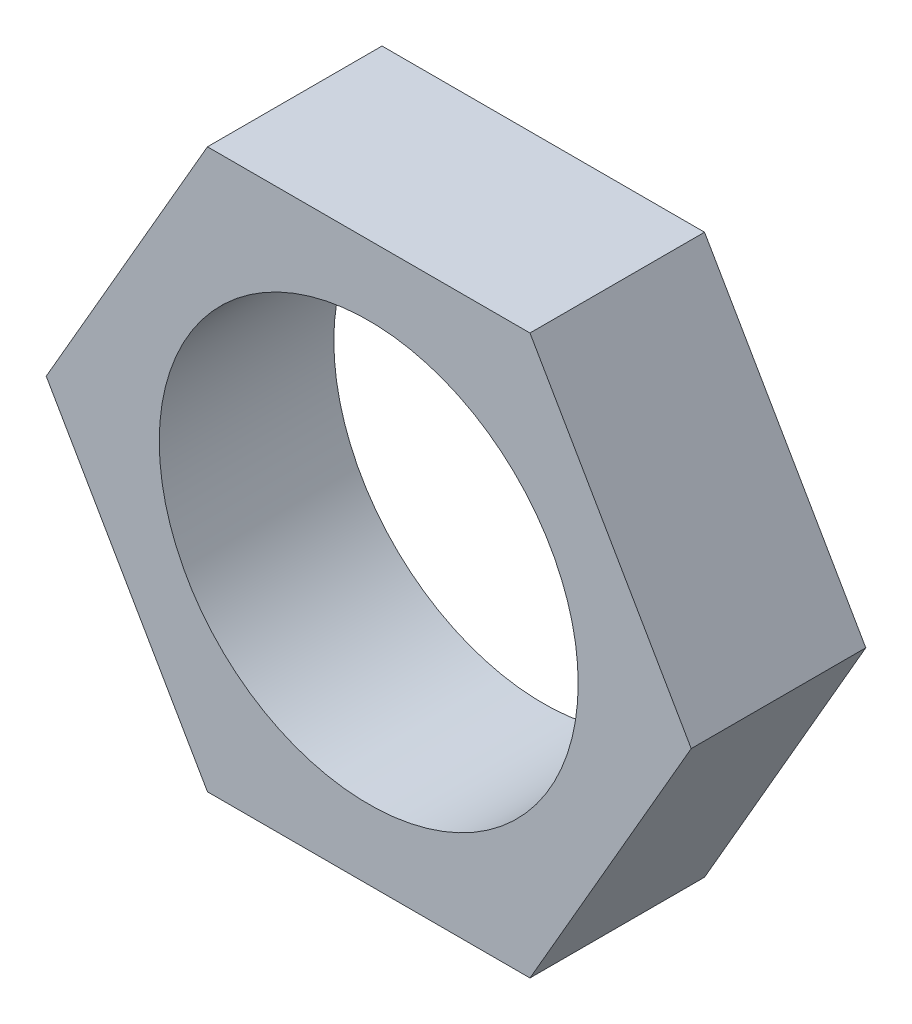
ISO-10303-21;
HEADER;
FILE_DESCRIPTION(('STEP AP214'),'2;1');
FILE_NAME('part.step','',(''),(''),'','','');
FILE_SCHEMA(('AUTOMOTIVE_DESIGN { 1 0 10303 214 1 1 1 1 }'));
ENDSEC;
DATA;
#1=APPLICATION_CONTEXT('core data for automotive mechanical design processes');
#2=APPLICATION_PROTOCOL_DEFINITION('international standard','automotive_design',2000,#1);
#3=PRODUCT_CONTEXT('',#1,'mechanical');
#4=PRODUCT('Part','Part','',(#3));
#5=PRODUCT_RELATED_PRODUCT_CATEGORY('part','',(#4));
#6=PRODUCT_DEFINITION_FORMATION('','',#4);
#7=PRODUCT_DEFINITION_CONTEXT('part definition',#1,'design');
#8=PRODUCT_DEFINITION('design','',#6,#7);
#9=PRODUCT_DEFINITION_SHAPE('','',#8);
#10=(LENGTH_UNIT() NAMED_UNIT(*) SI_UNIT(.MILLI.,.METRE.));
#11=(NAMED_UNIT(*) PLANE_ANGLE_UNIT() SI_UNIT($,.RADIAN.));
#12=(NAMED_UNIT(*) SI_UNIT($,.STERADIAN.) SOLID_ANGLE_UNIT());
#13=UNCERTAINTY_MEASURE_WITH_UNIT(LENGTH_MEASURE(1.E-05),#10,'distance_accuracy_value','');
#14=(GEOMETRIC_REPRESENTATION_CONTEXT(3) GLOBAL_UNCERTAINTY_ASSIGNED_CONTEXT((#13)) GLOBAL_UNIT_ASSIGNED_CONTEXT((#10,
#11,#12)) REPRESENTATION_CONTEXT('',''));
#15=CARTESIAN_POINT('',(0.,0.,0.));
#16=DIRECTION('',(0.,0.,1.));
#17=DIRECTION('',(1.,0.,0.));
#18=AXIS2_PLACEMENT_3D('',#15,#16,#17);
#19=CARTESIAN_POINT('',(0.,0.,5.));
#20=DIRECTION('',(0.,0.,1.));
#21=DIRECTION('',(1.,0.,0.));
#22=AXIS2_PLACEMENT_3D('',#19,#20,#21);
#23=PLANE('',#22);
#24=DIRECTION('',(0.5,0.866025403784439,0.));
#25=VECTOR('',#24,1.);
#26=CARTESIAN_POINT('',(4.618802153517,-8.00000000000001,5.));
#27=LINE('',#26,#25);
#28=CARTESIAN_POINT('',(4.618802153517,-8.00000000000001,5.));
#29=VERTEX_POINT('',#28);
#30=CARTESIAN_POINT('',(9.23760430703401,0.,5.));
#31=VERTEX_POINT('',#30);
#32=EDGE_CURVE('E132',#29,#31,#27,.T.);
#33=ORIENTED_EDGE('',*,*,#32,.T.);
#34=DIRECTION('',(-0.5,0.866025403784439,0.));
#35=VECTOR('',#34,1.);
#36=CARTESIAN_POINT('',(9.23760430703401,0.,5.));
#37=LINE('',#36,#35);
#38=CARTESIAN_POINT('',(4.61880215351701,8.,5.));
#39=VERTEX_POINT('',#38);
#40=EDGE_CURVE('E90',#31,#39,#37,.T.);
#41=ORIENTED_EDGE('',*,*,#40,.T.);
#42=DIRECTION('',(-1.,0.,0.));
#43=VECTOR('',#42,1.);
#44=CARTESIAN_POINT('',(4.61880215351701,8.,5.));
#45=LINE('',#44,#43);
#46=CARTESIAN_POINT('',(-4.61880215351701,8.,5.));
#47=VERTEX_POINT('',#46);
#48=EDGE_CURVE('E103',#39,#47,#45,.T.);
#49=ORIENTED_EDGE('',*,*,#48,.T.);
#50=DIRECTION('',(-0.5,-0.866025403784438,0.));
#51=VECTOR('',#50,1.);
#52=CARTESIAN_POINT('',(-4.61880215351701,8.,5.));
#53=LINE('',#52,#51);
#54=CARTESIAN_POINT('',(-9.23760430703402,0.,5.));
#55=VERTEX_POINT('',#54);
#56=EDGE_CURVE('E97',#47,#55,#53,.T.);
#57=ORIENTED_EDGE('',*,*,#56,.T.);
#58=DIRECTION('',(0.5,-0.866025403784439,0.));
#59=VECTOR('',#58,1.);
#60=CARTESIAN_POINT('',(-9.23760430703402,0.,5.));
#61=LINE('',#60,#59);
#62=CARTESIAN_POINT('',(-4.61880215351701,-8.,5.));
#63=VERTEX_POINT('',#62);
#64=EDGE_CURVE('E101',#55,#63,#61,.T.);
#65=ORIENTED_EDGE('',*,*,#64,.T.);
#66=DIRECTION('',(1.,0.,0.));
#67=VECTOR('',#66,1.);
#68=CARTESIAN_POINT('',(-4.61880215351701,-8.,5.));
#69=LINE('',#68,#67);
#70=EDGE_CURVE('E53',#63,#29,#69,.T.);
#71=ORIENTED_EDGE('',*,*,#70,.T.);
#72=EDGE_LOOP('',(#33,#41,#49,#57,#65,#71));
#73=FACE_BOUND('',#72,.T.);
#74=CARTESIAN_POINT('',(0.,0.,5.));
#75=DIRECTION('',(0.,0.,1.));
#76=DIRECTION('',(1.,0.,0.));
#77=AXIS2_PLACEMENT_3D('',#74,#75,#76);
#78=CIRCLE('',#77,6.);
#79=CARTESIAN_POINT('',(6.,0.,5.));
#80=VERTEX_POINT('',#79);
#81=EDGE_CURVE('E125',#80,#80,#78,.T.);
#82=ORIENTED_EDGE('',*,*,#81,.F.);
#83=EDGE_LOOP('',(#82));
#84=FACE_BOUND('',#83,.T.);
#85=ADVANCED_FACE('F36',(#73,#84),#23,.T.);
#86=CARTESIAN_POINT('',(0.,0.,0.));
#87=DIRECTION('',(0.,0.,1.));
#88=DIRECTION('',(1.,0.,0.));
#89=AXIS2_PLACEMENT_3D('',#86,#87,#88);
#90=PLANE('',#89);
#91=DIRECTION('',(0.5,0.866025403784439,0.));
#92=VECTOR('',#91,1.);
#93=CARTESIAN_POINT('',(4.618802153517,-8.00000000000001,0.));
#94=LINE('',#93,#92);
#95=CARTESIAN_POINT('',(4.618802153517,-8.00000000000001,0.));
#96=VERTEX_POINT('',#95);
#97=CARTESIAN_POINT('',(9.23760430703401,0.,0.));
#98=VERTEX_POINT('',#97);
#99=EDGE_CURVE('E121',#96,#98,#94,.T.);
#100=ORIENTED_EDGE('',*,*,#99,.F.);
#101=DIRECTION('',(1.,0.,0.));
#102=VECTOR('',#101,1.);
#103=CARTESIAN_POINT('',(-4.61880215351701,-8.,0.));
#104=LINE('',#103,#102);
#105=CARTESIAN_POINT('',(-4.61880215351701,-8.,0.));
#106=VERTEX_POINT('',#105);
#107=EDGE_CURVE('E82',#106,#96,#104,.T.);
#108=ORIENTED_EDGE('',*,*,#107,.F.);
#109=DIRECTION('',(0.5,-0.866025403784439,0.));
#110=VECTOR('',#109,1.);
#111=CARTESIAN_POINT('',(-9.23760430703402,0.,0.));
#112=LINE('',#111,#110);
#113=CARTESIAN_POINT('',(-9.23760430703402,0.,0.));
#114=VERTEX_POINT('',#113);
#115=EDGE_CURVE('E76',#114,#106,#112,.T.);
#116=ORIENTED_EDGE('',*,*,#115,.F.);
#117=DIRECTION('',(-0.5,-0.866025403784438,0.));
#118=VECTOR('',#117,1.);
#119=CARTESIAN_POINT('',(-4.61880215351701,8.,0.));
#120=LINE('',#119,#118);
#121=CARTESIAN_POINT('',(-4.61880215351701,8.,0.));
#122=VERTEX_POINT('',#121);
#123=EDGE_CURVE('E111',#122,#114,#120,.T.);
#124=ORIENTED_EDGE('',*,*,#123,.F.);
#125=DIRECTION('',(-1.,0.,0.));
#126=VECTOR('',#125,1.);
#127=CARTESIAN_POINT('',(4.61880215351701,8.,0.));
#128=LINE('',#127,#126);
#129=CARTESIAN_POINT('',(4.61880215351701,8.,0.));
#130=VERTEX_POINT('',#129);
#131=EDGE_CURVE('E127',#130,#122,#128,.T.);
#132=ORIENTED_EDGE('',*,*,#131,.F.);
#133=DIRECTION('',(-0.5,0.866025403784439,0.));
#134=VECTOR('',#133,1.);
#135=CARTESIAN_POINT('',(9.23760430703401,0.,0.));
#136=LINE('',#135,#134);
#137=EDGE_CURVE('E124',#98,#130,#136,.T.);
#138=ORIENTED_EDGE('',*,*,#137,.F.);
#139=EDGE_LOOP('',(#100,#108,#116,#124,#132,#138));
#140=FACE_BOUND('',#139,.T.);
#141=CARTESIAN_POINT('',(0.,0.,0.));
#142=DIRECTION('',(0.,0.,1.));
#143=DIRECTION('',(1.,0.,0.));
#144=AXIS2_PLACEMENT_3D('',#141,#142,#143);
#145=CIRCLE('',#144,6.);
#146=CARTESIAN_POINT('',(6.,0.,0.));
#147=VERTEX_POINT('',#146);
#148=EDGE_CURVE('E243',#147,#147,#145,.T.);
#149=ORIENTED_EDGE('',*,*,#148,.T.);
#150=EDGE_LOOP('',(#149));
#151=FACE_BOUND('',#150,.T.);
#152=ADVANCED_FACE('F141',(#140,#151),#90,.F.);
#153=CARTESIAN_POINT('',(4.618802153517,-8.00000000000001,5.));
#154=DIRECTION('',(-0.866025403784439,0.5,0.));
#155=DIRECTION('',(-0.5,-0.866025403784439,0.));
#156=AXIS2_PLACEMENT_3D('',#153,#154,#155);
#157=PLANE('',#156);
#158=ORIENTED_EDGE('',*,*,#99,.T.);
#159=DIRECTION('',(0.,0.,-1.));
#160=VECTOR('',#159,1.);
#161=CARTESIAN_POINT('',(9.23760430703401,0.,5.));
#162=LINE('',#161,#160);
#163=EDGE_CURVE('E11',#31,#98,#162,.T.);
#164=ORIENTED_EDGE('',*,*,#163,.F.);
#165=ORIENTED_EDGE('',*,*,#32,.F.);
#166=DIRECTION('',(0.,0.,-1.));
#167=VECTOR('',#166,1.);
#168=CARTESIAN_POINT('',(4.618802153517,-8.00000000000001,5.));
#169=LINE('',#168,#167);
#170=EDGE_CURVE('E117',#29,#96,#169,.T.);
#171=ORIENTED_EDGE('',*,*,#170,.T.);
#172=EDGE_LOOP('',(#158,#164,#165,#171));
#173=FACE_BOUND('',#172,.T.);
#174=ADVANCED_FACE('F38',(#173),#157,.F.);
#175=CARTESIAN_POINT('',(9.23760430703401,0.,5.));
#176=DIRECTION('',(-0.866025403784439,-0.5,0.));
#177=DIRECTION('',(0.5,-0.866025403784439,0.));
#178=AXIS2_PLACEMENT_3D('',#175,#176,#177);
#179=PLANE('',#178);
#180=ORIENTED_EDGE('',*,*,#137,.T.);
#181=DIRECTION('',(0.,0.,-1.));
#182=VECTOR('',#181,1.);
#183=CARTESIAN_POINT('',(4.61880215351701,8.,5.));
#184=LINE('',#183,#182);
#185=EDGE_CURVE('E45',#39,#130,#184,.T.);
#186=ORIENTED_EDGE('',*,*,#185,.F.);
#187=ORIENTED_EDGE('',*,*,#40,.F.);
#188=ORIENTED_EDGE('',*,*,#163,.T.);
#189=EDGE_LOOP('',(#180,#186,#187,#188));
#190=FACE_BOUND('',#189,.T.);
#191=ADVANCED_FACE('F166',(#190),#179,.F.);
#192=CARTESIAN_POINT('',(4.61880215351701,8.,5.));
#193=DIRECTION('',(0.,-1.,0.));
#194=DIRECTION('',(1.,0.,0.));
#195=AXIS2_PLACEMENT_3D('',#192,#193,#194);
#196=PLANE('',#195);
#197=ORIENTED_EDGE('',*,*,#131,.T.);
#198=DIRECTION('',(0.,0.,-1.));
#199=VECTOR('',#198,1.);
#200=CARTESIAN_POINT('',(-4.61880215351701,8.,5.));
#201=LINE('',#200,#199);
#202=EDGE_CURVE('E112',#47,#122,#201,.T.);
#203=ORIENTED_EDGE('',*,*,#202,.F.);
#204=ORIENTED_EDGE('',*,*,#48,.F.);
#205=ORIENTED_EDGE('',*,*,#185,.T.);
#206=EDGE_LOOP('',(#197,#203,#204,#205));
#207=FACE_BOUND('',#206,.T.);
#208=ADVANCED_FACE('F138',(#207),#196,.F.);
#209=CARTESIAN_POINT('',(-4.61880215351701,8.,5.));
#210=DIRECTION('',(0.866025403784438,-0.5,0.));
#211=DIRECTION('',(0.5,0.866025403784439,0.));
#212=AXIS2_PLACEMENT_3D('',#209,#210,#211);
#213=PLANE('',#212);
#214=ORIENTED_EDGE('',*,*,#123,.T.);
#215=DIRECTION('',(0.,0.,-1.));
#216=VECTOR('',#215,1.);
#217=CARTESIAN_POINT('',(-9.23760430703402,0.,5.));
#218=LINE('',#217,#216);
#219=EDGE_CURVE('E108',#55,#114,#218,.T.);
#220=ORIENTED_EDGE('',*,*,#219,.F.);
#221=ORIENTED_EDGE('',*,*,#56,.F.);
#222=ORIENTED_EDGE('',*,*,#202,.T.);
#223=EDGE_LOOP('',(#214,#220,#221,#222));
#224=FACE_BOUND('',#223,.T.);
#225=ADVANCED_FACE('F109',(#224),#213,.F.);
#226=CARTESIAN_POINT('',(-9.23760430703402,0.,5.));
#227=DIRECTION('',(0.866025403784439,0.5,0.));
#228=DIRECTION('',(-0.5,0.866025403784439,0.));
#229=AXIS2_PLACEMENT_3D('',#226,#227,#228);
#230=PLANE('',#229);
#231=ORIENTED_EDGE('',*,*,#115,.T.);
#232=DIRECTION('',(0.,0.,-1.));
#233=VECTOR('',#232,1.);
#234=CARTESIAN_POINT('',(-4.61880215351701,-8.,5.));
#235=LINE('',#234,#233);
#236=EDGE_CURVE('E113',#63,#106,#235,.T.);
#237=ORIENTED_EDGE('',*,*,#236,.F.);
#238=ORIENTED_EDGE('',*,*,#64,.F.);
#239=ORIENTED_EDGE('',*,*,#219,.T.);
#240=EDGE_LOOP('',(#231,#237,#238,#239));
#241=FACE_BOUND('',#240,.T.);
#242=ADVANCED_FACE('F115',(#241),#230,.F.);
#243=CARTESIAN_POINT('',(-4.61880215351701,-8.,5.));
#244=DIRECTION('',(0.,1.,0.));
#245=DIRECTION('',(-1.,0.,0.));
#246=AXIS2_PLACEMENT_3D('',#243,#244,#245);
#247=PLANE('',#246);
#248=ORIENTED_EDGE('',*,*,#107,.T.);
#249=ORIENTED_EDGE('',*,*,#170,.F.);
#250=ORIENTED_EDGE('',*,*,#70,.F.);
#251=ORIENTED_EDGE('',*,*,#236,.T.);
#252=EDGE_LOOP('',(#248,#249,#250,#251));
#253=FACE_BOUND('',#252,.T.);
#254=ADVANCED_FACE('F146',(#253),#247,.F.);
#255=CARTESIAN_POINT('',(0.,0.,5.));
#256=DIRECTION('',(0.,0.,-1.));
#257=DIRECTION('',(-1.,0.,0.));
#258=AXIS2_PLACEMENT_3D('',#255,#256,#257);
#259=CYLINDRICAL_SURFACE('',#258,6.);
#260=ORIENTED_EDGE('',*,*,#81,.T.);
#261=EDGE_LOOP('',(#260));
#262=FACE_BOUND('',#261,.T.);
#263=ORIENTED_EDGE('',*,*,#148,.F.);
#264=EDGE_LOOP('',(#263));
#265=FACE_BOUND('',#264,.T.);
#266=ADVANCED_FACE('F148',(#262,#265),#259,.F.);
#267=CLOSED_SHELL('',(#85,#152,#174,#191,#208,#225,#242,#254,#266));
#268=MANIFOLD_SOLID_BREP('B2',#267);
#269=ADVANCED_BREP_SHAPE_REPRESENTATION('',(#18,#268),#14);
#270=SHAPE_DEFINITION_REPRESENTATION(#9,#269);
ENDSEC;
END-ISO-10303-21;
